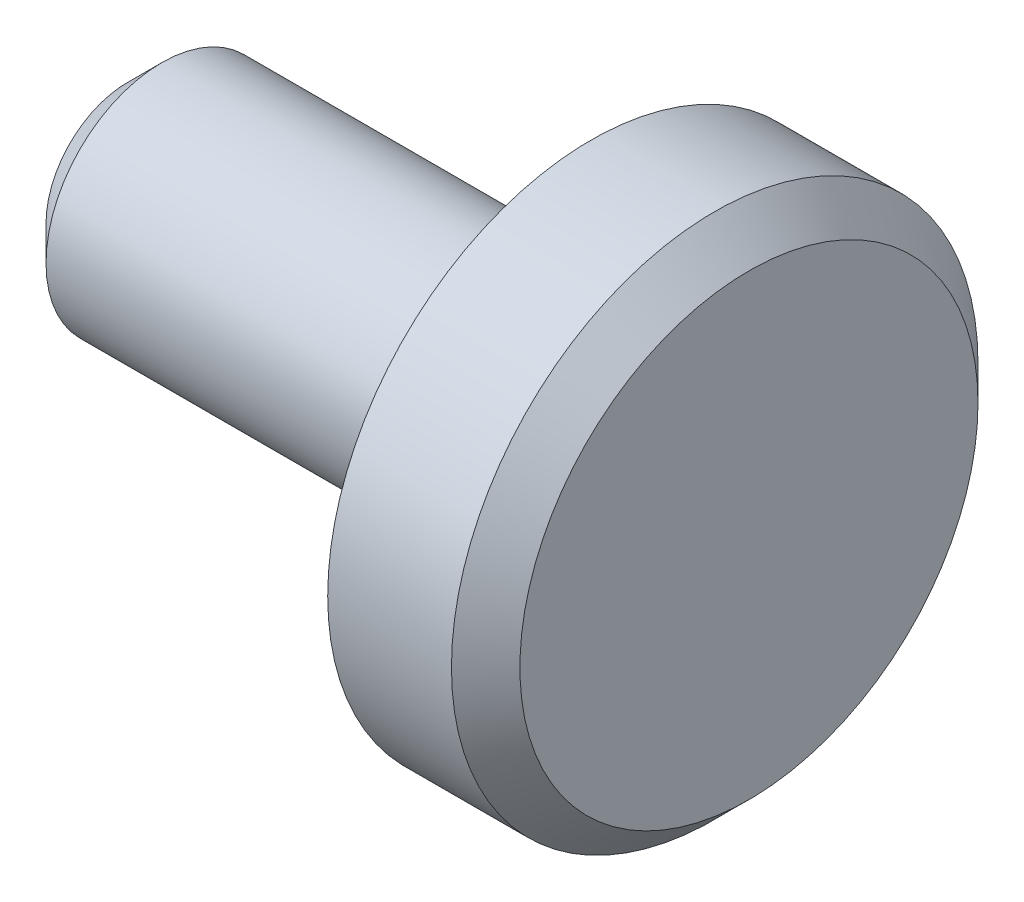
ISO-10303-21;
HEADER;
FILE_DESCRIPTION(('STEP AP214'),'2;1');
FILE_NAME('part.step','',(''),(''),'','','');
FILE_SCHEMA(('AUTOMOTIVE_DESIGN { 1 0 10303 214 1 1 1 1 }'));
ENDSEC;
DATA;
#1=APPLICATION_CONTEXT('core data for automotive mechanical design processes');
#2=APPLICATION_PROTOCOL_DEFINITION('international standard','automotive_design',2000,#1);
#3=PRODUCT_CONTEXT('',#1,'mechanical');
#4=PRODUCT('Part','Part','',(#3));
#5=PRODUCT_RELATED_PRODUCT_CATEGORY('part','',(#4));
#6=PRODUCT_DEFINITION_FORMATION('','',#4);
#7=PRODUCT_DEFINITION_CONTEXT('part definition',#1,'design');
#8=PRODUCT_DEFINITION('design','',#6,#7);
#9=PRODUCT_DEFINITION_SHAPE('','',#8);
#10=(LENGTH_UNIT() NAMED_UNIT(*) SI_UNIT(.MILLI.,.METRE.));
#11=(NAMED_UNIT(*) PLANE_ANGLE_UNIT() SI_UNIT($,.RADIAN.));
#12=(NAMED_UNIT(*) SI_UNIT($,.STERADIAN.) SOLID_ANGLE_UNIT());
#13=UNCERTAINTY_MEASURE_WITH_UNIT(LENGTH_MEASURE(1.E-05),#10,'distance_accuracy_value','');
#14=(GEOMETRIC_REPRESENTATION_CONTEXT(3) GLOBAL_UNCERTAINTY_ASSIGNED_CONTEXT((#13)) GLOBAL_UNIT_ASSIGNED_CONTEXT((#10,
#11,#12)) REPRESENTATION_CONTEXT('',''));
#15=CARTESIAN_POINT('',(0.,0.,0.));
#16=DIRECTION('',(0.,0.,1.));
#17=DIRECTION('',(1.,0.,0.));
#18=AXIS2_PLACEMENT_3D('',#15,#16,#17);
#19=CARTESIAN_POINT('',(0.,6.35,0.));
#20=DIRECTION('',(1.,0.,0.));
#21=DIRECTION('',(0.,0.,-1.));
#22=AXIS2_PLACEMENT_3D('',#19,#20,#21);
#23=PLANE('',#22);
#24=CARTESIAN_POINT('',(0.,0.,0.));
#25=DIRECTION('',(1.,0.,0.));
#26=DIRECTION('',(0.,0.,-1.));
#27=AXIS2_PLACEMENT_3D('',#24,#25,#26);
#28=CIRCLE('',#27,5.5245);
#29=CARTESIAN_POINT('',(0.,0.,-5.5245));
#30=VERTEX_POINT('',#29);
#31=EDGE_CURVE('E42',#30,#30,#28,.T.);
#32=ORIENTED_EDGE('',*,*,#31,.T.);
#33=EDGE_LOOP('',(#32));
#34=FACE_BOUND('',#33,.T.);
#35=ADVANCED_FACE('F28',(#34),#23,.T.);
#36=CARTESIAN_POINT('',(-14.986,0.,0.));
#37=DIRECTION('',(-1.,0.,0.));
#38=DIRECTION('',(0.,0.,1.));
#39=AXIS2_PLACEMENT_3D('',#36,#37,#38);
#40=PLANE('',#39);
#41=CARTESIAN_POINT('',(-14.986,0.,0.));
#42=DIRECTION('',(-1.,0.,0.));
#43=DIRECTION('',(0.,0.,1.));
#44=AXIS2_PLACEMENT_3D('',#41,#42,#43);
#45=CIRCLE('',#44,1.9685);
#46=CARTESIAN_POINT('',(-14.986,0.,1.9685));
#47=VERTEX_POINT('',#46);
#48=EDGE_CURVE('E10',#47,#47,#45,.T.);
#49=ORIENTED_EDGE('',*,*,#48,.T.);
#50=EDGE_LOOP('',(#49));
#51=FACE_BOUND('',#50,.T.);
#52=ADVANCED_FACE('F68',(#51),#40,.T.);
#53=CARTESIAN_POINT('',(0.,0.,0.));
#54=DIRECTION('',(1.,0.,0.));
#55=DIRECTION('',(0.,0.,-1.));
#56=AXIS2_PLACEMENT_3D('',#53,#54,#55);
#57=CYLINDRICAL_SURFACE('',#56,2.794);
#58=CARTESIAN_POINT('',(-14.1605,0.,0.));
#59=DIRECTION('',(-1.,0.,0.));
#60=DIRECTION('',(0.,0.,1.));
#61=AXIS2_PLACEMENT_3D('',#58,#59,#60);
#62=CIRCLE('',#61,2.794);
#63=CARTESIAN_POINT('',(-14.1605,0.,2.794));
#64=VERTEX_POINT('',#63);
#65=EDGE_CURVE('E34',#64,#64,#62,.F.);
#66=ORIENTED_EDGE('',*,*,#65,.T.);
#67=EDGE_LOOP('',(#66));
#68=FACE_BOUND('',#67,.T.);
#69=CARTESIAN_POINT('',(-3.81,0.,0.));
#70=DIRECTION('',(1.,0.,0.));
#71=DIRECTION('',(0.,0.,-1.));
#72=AXIS2_PLACEMENT_3D('',#69,#70,#71);
#73=CIRCLE('',#72,2.794);
#74=CARTESIAN_POINT('',(-3.81,0.,-2.794));
#75=VERTEX_POINT('',#74);
#76=EDGE_CURVE('E47',#75,#75,#73,.T.);
#77=ORIENTED_EDGE('',*,*,#76,.F.);
#78=EDGE_LOOP('',(#77));
#79=FACE_BOUND('',#78,.T.);
#80=ADVANCED_FACE('F58',(#68,#79),#57,.T.);
#81=CARTESIAN_POINT('',(-3.81,2.794,0.));
#82=DIRECTION('',(-1.,0.,0.));
#83=DIRECTION('',(0.,0.,1.));
#84=AXIS2_PLACEMENT_3D('',#81,#82,#83);
#85=PLANE('',#84);
#86=ORIENTED_EDGE('',*,*,#76,.T.);
#87=EDGE_LOOP('',(#86));
#88=FACE_BOUND('',#87,.T.);
#89=CARTESIAN_POINT('',(-3.81,0.,0.));
#90=DIRECTION('',(1.,0.,0.));
#91=DIRECTION('',(0.,0.,-1.));
#92=AXIS2_PLACEMENT_3D('',#89,#90,#91);
#93=CIRCLE('',#92,6.35);
#94=CARTESIAN_POINT('',(-3.81,0.,-6.35));
#95=VERTEX_POINT('',#94);
#96=EDGE_CURVE('E50',#95,#95,#93,.T.);
#97=ORIENTED_EDGE('',*,*,#96,.F.);
#98=EDGE_LOOP('',(#97));
#99=FACE_BOUND('',#98,.T.);
#100=ADVANCED_FACE('F56',(#88,#99),#85,.T.);
#101=CARTESIAN_POINT('',(0.,0.,0.));
#102=DIRECTION('',(1.,0.,0.));
#103=DIRECTION('',(0.,0.,-1.));
#104=AXIS2_PLACEMENT_3D('',#101,#102,#103);
#105=CYLINDRICAL_SURFACE('',#104,6.35);
#106=CARTESIAN_POINT('',(-0.825500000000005,0.,0.));
#107=DIRECTION('',(1.,0.,0.));
#108=DIRECTION('',(0.,0.,-1.));
#109=AXIS2_PLACEMENT_3D('',#106,#107,#108);
#110=CIRCLE('',#109,6.35);
#111=CARTESIAN_POINT('',(-0.825500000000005,0.,-6.35));
#112=VERTEX_POINT('',#111);
#113=EDGE_CURVE('E38',#112,#112,#110,.F.);
#114=ORIENTED_EDGE('',*,*,#113,.T.);
#115=EDGE_LOOP('',(#114));
#116=FACE_BOUND('',#115,.T.);
#117=ORIENTED_EDGE('',*,*,#96,.T.);
#118=EDGE_LOOP('',(#117));
#119=FACE_BOUND('',#118,.T.);
#120=ADVANCED_FACE('F54',(#116,#119),#105,.T.);
#121=CARTESIAN_POINT('',(0.,0.,0.));
#122=DIRECTION('',(-1.,0.,0.));
#123=DIRECTION('',(0.,0.,1.));
#124=AXIS2_PLACEMENT_3D('',#121,#122,#123);
#125=CONICAL_SURFACE('',#124,5.5245,0.785398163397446);
#126=ORIENTED_EDGE('',*,*,#113,.F.);
#127=EDGE_LOOP('',(#126));
#128=FACE_BOUND('',#127,.T.);
#129=ORIENTED_EDGE('',*,*,#31,.F.);
#130=EDGE_LOOP('',(#129));
#131=FACE_BOUND('',#130,.T.);
#132=ADVANCED_FACE('F65',(#128,#131),#125,.T.);
#133=CARTESIAN_POINT('',(-14.1605,0.,0.));
#134=DIRECTION('',(1.,0.,0.));
#135=DIRECTION('',(0.,0.,-1.));
#136=AXIS2_PLACEMENT_3D('',#133,#134,#135);
#137=CONICAL_SURFACE('',#136,2.794,0.785398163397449);
#138=ORIENTED_EDGE('',*,*,#48,.F.);
#139=EDGE_LOOP('',(#138));
#140=FACE_BOUND('',#139,.T.);
#141=ORIENTED_EDGE('',*,*,#65,.F.);
#142=EDGE_LOOP('',(#141));
#143=FACE_BOUND('',#142,.T.);
#144=ADVANCED_FACE('F78',(#140,#143),#137,.T.);
#145=CLOSED_SHELL('',(#35,#52,#80,#100,#120,#132,#144));
#146=MANIFOLD_SOLID_BREP('B2',#145);
#147=ADVANCED_BREP_SHAPE_REPRESENTATION('',(#18,#146),#14);
#148=SHAPE_DEFINITION_REPRESENTATION(#9,#147);
ENDSEC;
END-ISO-10303-21;
